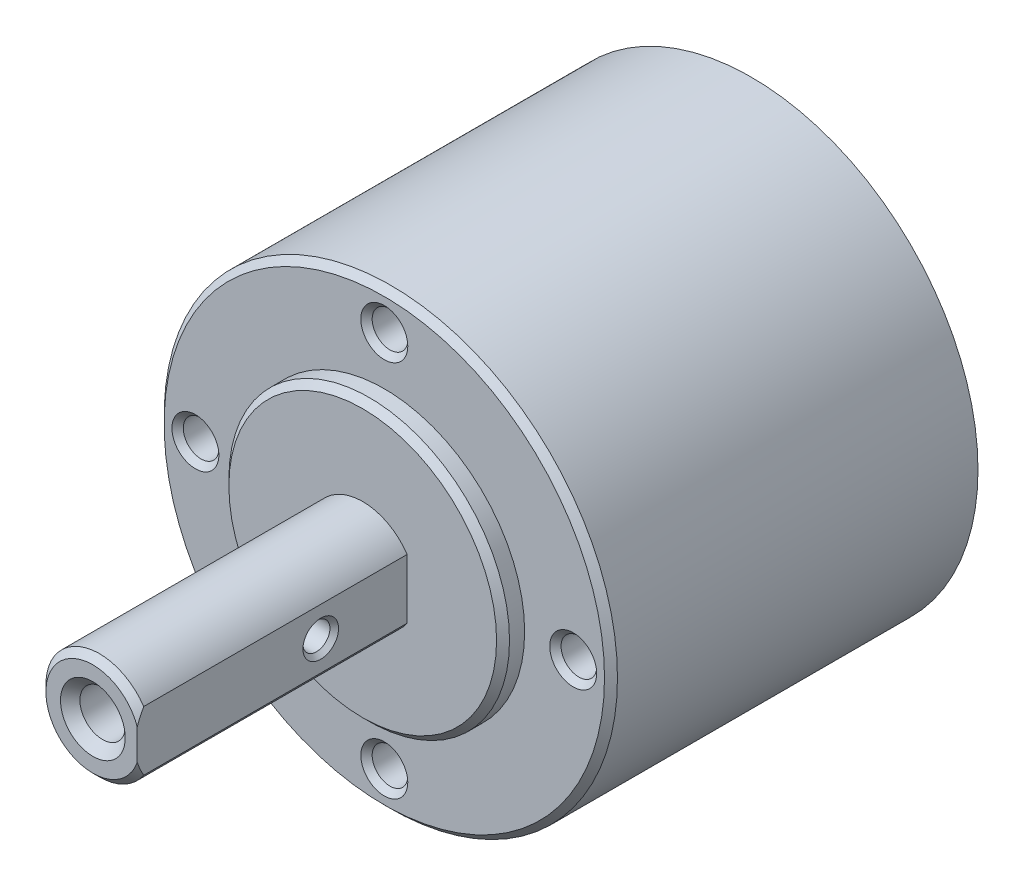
ISO-10303-21;
HEADER;
FILE_DESCRIPTION(('STEP AP214'),'2;1');
FILE_NAME('part.step','',(''),(''),'','','');
FILE_SCHEMA(('AUTOMOTIVE_DESIGN { 1 0 10303 214 1 1 1 1 }'));
ENDSEC;
DATA;
#1=APPLICATION_CONTEXT('core data for automotive mechanical design processes');
#2=APPLICATION_PROTOCOL_DEFINITION('international standard','automotive_design',2000,#1);
#3=PRODUCT_CONTEXT('',#1,'mechanical');
#4=PRODUCT('Part','Part','',(#3));
#5=PRODUCT_RELATED_PRODUCT_CATEGORY('part','',(#4));
#6=PRODUCT_DEFINITION_FORMATION('','',#4);
#7=PRODUCT_DEFINITION_CONTEXT('part definition',#1,'design');
#8=PRODUCT_DEFINITION('design','',#6,#7);
#9=PRODUCT_DEFINITION_SHAPE('','',#8);
#10=(LENGTH_UNIT() NAMED_UNIT(*) SI_UNIT(.MILLI.,.METRE.));
#11=(NAMED_UNIT(*) PLANE_ANGLE_UNIT() SI_UNIT($,.RADIAN.));
#12=(NAMED_UNIT(*) SI_UNIT($,.STERADIAN.) SOLID_ANGLE_UNIT());
#13=UNCERTAINTY_MEASURE_WITH_UNIT(LENGTH_MEASURE(1.E-05),#10,'distance_accuracy_value','');
#14=(GEOMETRIC_REPRESENTATION_CONTEXT(3) GLOBAL_UNCERTAINTY_ASSIGNED_CONTEXT((#13)) GLOBAL_UNIT_ASSIGNED_CONTEXT((#10,
#11,#12)) REPRESENTATION_CONTEXT('',''));
#15=CARTESIAN_POINT('',(0.,0.,0.));
#16=DIRECTION('',(0.,0.,1.));
#17=DIRECTION('',(1.,0.,0.));
#18=AXIS2_PLACEMENT_3D('',#15,#16,#17);
#19=CARTESIAN_POINT('',(0.,0.,34.));
#20=DIRECTION('',(0.,0.,-1.));
#21=DIRECTION('',(-1.,0.,0.));
#22=AXIS2_PLACEMENT_3D('',#19,#20,#21);
#23=CYLINDRICAL_SURFACE('',#22,21.);
#24=CARTESIAN_POINT('',(0.,0.,33.4));
#25=DIRECTION('',(0.,0.,1.));
#26=DIRECTION('',(1.,0.,0.));
#27=AXIS2_PLACEMENT_3D('',#24,#25,#26);
#28=CIRCLE('',#27,21.);
#29=CARTESIAN_POINT('',(21.,0.,33.4));
#30=VERTEX_POINT('',#29);
#31=EDGE_CURVE('E220',#30,#30,#28,.F.);
#32=ORIENTED_EDGE('',*,*,#31,.T.);
#33=EDGE_LOOP('',(#32));
#34=FACE_BOUND('',#33,.T.);
#35=CARTESIAN_POINT('',(0.,0.,0.));
#36=DIRECTION('',(0.,0.,1.));
#37=DIRECTION('',(1.,0.,0.));
#38=AXIS2_PLACEMENT_3D('',#35,#36,#37);
#39=CIRCLE('',#38,21.);
#40=CARTESIAN_POINT('',(21.,0.,0.));
#41=VERTEX_POINT('',#40);
#42=EDGE_CURVE('E158',#41,#41,#39,.T.);
#43=ORIENTED_EDGE('',*,*,#42,.T.);
#44=EDGE_LOOP('',(#43));
#45=FACE_BOUND('',#44,.T.);
#46=ADVANCED_FACE('F36',(#34,#45),#23,.T.);
#47=CARTESIAN_POINT('',(0.,0.,34.));
#48=DIRECTION('',(0.,0.,1.));
#49=DIRECTION('',(1.,0.,0.));
#50=AXIS2_PLACEMENT_3D('',#47,#48,#49);
#51=PLANE('',#50);
#52=CARTESIAN_POINT('',(0.,17.5,34.));
#53=DIRECTION('',(0.,0.,1.));
#54=DIRECTION('',(1.,0.,0.));
#55=AXIS2_PLACEMENT_3D('',#52,#53,#54);
#56=CIRCLE('',#55,2.175);
#57=CARTESIAN_POINT('',(2.175,17.5,34.));
#58=VERTEX_POINT('',#57);
#59=EDGE_CURVE('E100',#58,#58,#56,.T.);
#60=ORIENTED_EDGE('',*,*,#59,.F.);
#61=EDGE_LOOP('',(#60));
#62=FACE_BOUND('',#61,.T.);
#63=CARTESIAN_POINT('',(9.90473566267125E-13,-17.5,34.));
#64=DIRECTION('',(0.,0.,1.));
#65=DIRECTION('',(1.,0.,0.));
#66=AXIS2_PLACEMENT_3D('',#63,#64,#65);
#67=CIRCLE('',#66,2.175);
#68=CARTESIAN_POINT('',(2.17500000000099,-17.5,34.));
#69=VERTEX_POINT('',#68);
#70=EDGE_CURVE('E93',#69,#69,#67,.T.);
#71=ORIENTED_EDGE('',*,*,#70,.F.);
#72=EDGE_LOOP('',(#71));
#73=FACE_BOUND('',#72,.T.);
#74=CARTESIAN_POINT('',(-17.4999999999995,-4.9737991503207E-13,34.));
#75=DIRECTION('',(0.,0.,1.));
#76=DIRECTION('',(1.,0.,0.));
#77=AXIS2_PLACEMENT_3D('',#74,#75,#76);
#78=CIRCLE('',#77,2.175);
#79=CARTESIAN_POINT('',(-15.3249999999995,-4.9737991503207E-13,34.));
#80=VERTEX_POINT('',#79);
#81=EDGE_CURVE('E109',#80,#80,#78,.T.);
#82=ORIENTED_EDGE('',*,*,#81,.F.);
#83=EDGE_LOOP('',(#82));
#84=FACE_BOUND('',#83,.T.);
#85=CARTESIAN_POINT('',(17.5000000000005,4.95236783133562E-13,34.));
#86=DIRECTION('',(0.,0.,1.));
#87=DIRECTION('',(1.,0.,0.));
#88=AXIS2_PLACEMENT_3D('',#85,#86,#87);
#89=CIRCLE('',#88,2.175);
#90=CARTESIAN_POINT('',(19.6750000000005,4.95236783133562E-13,34.));
#91=VERTEX_POINT('',#90);
#92=EDGE_CURVE('E118',#91,#91,#89,.T.);
#93=ORIENTED_EDGE('',*,*,#92,.F.);
#94=EDGE_LOOP('',(#93));
#95=FACE_BOUND('',#94,.T.);
#96=CARTESIAN_POINT('',(0.,0.,34.));
#97=DIRECTION('',(0.,0.,1.));
#98=DIRECTION('',(1.,0.,0.));
#99=AXIS2_PLACEMENT_3D('',#96,#97,#98);
#100=CIRCLE('',#99,20.4);
#101=CARTESIAN_POINT('',(20.4,0.,34.));
#102=VERTEX_POINT('',#101);
#103=EDGE_CURVE('E161',#102,#102,#100,.T.);
#104=ORIENTED_EDGE('',*,*,#103,.T.);
#105=EDGE_LOOP('',(#104));
#106=FACE_BOUND('',#105,.T.);
#107=CARTESIAN_POINT('',(0.,0.,34.));
#108=DIRECTION('',(0.,0.,1.));
#109=DIRECTION('',(1.,0.,0.));
#110=AXIS2_PLACEMENT_3D('',#107,#108,#109);
#111=CIRCLE('',#110,13.);
#112=CARTESIAN_POINT('',(13.,0.,34.));
#113=VERTEX_POINT('',#112);
#114=EDGE_CURVE('E155',#113,#113,#111,.T.);
#115=ORIENTED_EDGE('',*,*,#114,.F.);
#116=EDGE_LOOP('',(#115));
#117=FACE_BOUND('',#116,.T.);
#118=ADVANCED_FACE('F227',(#62,#73,#84,#95,#106,#117),#51,.T.);
#119=CARTESIAN_POINT('',(0.,0.,0.));
#120=DIRECTION('',(0.,0.,1.));
#121=DIRECTION('',(1.,0.,0.));
#122=AXIS2_PLACEMENT_3D('',#119,#120,#121);
#123=PLANE('',#122);
#124=ORIENTED_EDGE('',*,*,#42,.F.);
#125=EDGE_LOOP('',(#124));
#126=FACE_BOUND('',#125,.T.);
#127=ADVANCED_FACE('F246',(#126),#123,.F.);
#128=CARTESIAN_POINT('',(0.,0.,36.));
#129=DIRECTION('',(0.,0.,-1.));
#130=DIRECTION('',(-1.,0.,0.));
#131=AXIS2_PLACEMENT_3D('',#128,#129,#130);
#132=CYLINDRICAL_SURFACE('',#131,13.);
#133=CARTESIAN_POINT('',(0.,0.,35.4));
#134=DIRECTION('',(0.,0.,1.));
#135=DIRECTION('',(1.,0.,0.));
#136=AXIS2_PLACEMENT_3D('',#133,#134,#135);
#137=CIRCLE('',#136,13.);
#138=CARTESIAN_POINT('',(13.,0.,35.4));
#139=VERTEX_POINT('',#138);
#140=EDGE_CURVE('E212',#139,#139,#137,.F.);
#141=ORIENTED_EDGE('',*,*,#140,.T.);
#142=EDGE_LOOP('',(#141));
#143=FACE_BOUND('',#142,.T.);
#144=ORIENTED_EDGE('',*,*,#114,.T.);
#145=EDGE_LOOP('',(#144));
#146=FACE_BOUND('',#145,.T.);
#147=ADVANCED_FACE('F252',(#143,#146),#132,.T.);
#148=CARTESIAN_POINT('',(0.,0.,36.));
#149=DIRECTION('',(0.,0.,1.));
#150=DIRECTION('',(1.,0.,0.));
#151=AXIS2_PLACEMENT_3D('',#148,#149,#150);
#152=PLANE('',#151);
#153=CARTESIAN_POINT('',(0.,0.,36.));
#154=DIRECTION('',(0.,0.,1.));
#155=DIRECTION('',(1.,0.,0.));
#156=AXIS2_PLACEMENT_3D('',#153,#154,#155);
#157=CIRCLE('',#156,12.4);
#158=CARTESIAN_POINT('',(12.4,0.,36.));
#159=VERTEX_POINT('',#158);
#160=EDGE_CURVE('E216',#159,#159,#157,.T.);
#161=ORIENTED_EDGE('',*,*,#160,.T.);
#162=EDGE_LOOP('',(#161));
#163=FACE_BOUND('',#162,.T.);
#164=CARTESIAN_POINT('',(0.,0.,36.));
#165=DIRECTION('',(0.,0.,1.));
#166=DIRECTION('',(1.,0.,0.));
#167=AXIS2_PLACEMENT_3D('',#164,#165,#166);
#168=CIRCLE('',#167,4.95);
#169=CARTESIAN_POINT('',(4.11111099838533,2.75703941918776,36.));
#170=VERTEX_POINT('',#169);
#171=CARTESIAN_POINT('',(4.11111099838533,-2.75703941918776,36.));
#172=VERTEX_POINT('',#171);
#173=EDGE_CURVE('E151',#170,#172,#168,.T.);
#174=ORIENTED_EDGE('',*,*,#173,.F.);
#175=DIRECTION('',(0.,-1.,0.));
#176=VECTOR('',#175,1.);
#177=CARTESIAN_POINT('',(4.11111099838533,-2.75703941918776,36.));
#178=LINE('',#177,#176);
#179=EDGE_CURVE('E144',#170,#172,#178,.T.);
#180=ORIENTED_EDGE('',*,*,#179,.T.);
#181=EDGE_LOOP('',(#174,#180));
#182=FACE_BOUND('',#181,.T.);
#183=ADVANCED_FACE('F256',(#163,#182),#152,.T.);
#184=CARTESIAN_POINT('',(0.,0.,61.));
#185=DIRECTION('',(0.,0.,-1.));
#186=DIRECTION('',(-1.,0.,0.));
#187=AXIS2_PLACEMENT_3D('',#184,#185,#186);
#188=CYLINDRICAL_SURFACE('',#187,4.95);
#189=CARTESIAN_POINT('',(-4.95,0.,42.75));
#190=CARTESIAN_POINT('',(-4.94999884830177,0.069040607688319,42.7500018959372));
#191=CARTESIAN_POINT('',(-4.94854120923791,0.138102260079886,42.7557391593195));
#192=CARTESIAN_POINT('',(-4.9428676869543,0.274244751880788,42.7785013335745));
#193=CARTESIAN_POINT('',(-4.93865027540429,0.341324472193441,42.7955324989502));
#194=CARTESIAN_POINT('',(-4.92792399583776,0.471517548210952,42.8403000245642));
#195=CARTESIAN_POINT('',(-4.92141791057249,0.534635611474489,42.8680233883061));
#196=CARTESIAN_POINT('',(-4.90680639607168,0.655325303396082,42.9333422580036));
#197=CARTESIAN_POINT('',(-4.89870090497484,0.712896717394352,42.9709381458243));
#198=CARTESIAN_POINT('',(-4.88157967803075,0.822066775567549,43.0557679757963));
#199=CARTESIAN_POINT('',(-4.8725496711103,0.873532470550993,43.103170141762));
#200=CARTESIAN_POINT('',(-4.85469148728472,0.967874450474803,43.2059068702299));
#201=CARTESIAN_POINT('',(-4.84586333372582,1.01074974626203,43.2612423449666));
#202=CARTESIAN_POINT('',(-4.82926422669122,1.0873225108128,43.3793114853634));
#203=CARTESIAN_POINT('',(-4.82151137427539,1.12087063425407,43.4421447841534));
#204=CARTESIAN_POINT('',(-4.80814905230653,1.1768761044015,43.5727867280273));
#205=CARTESIAN_POINT('',(-4.80253923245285,1.19933526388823,43.6405945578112));
#206=CARTESIAN_POINT('',(-4.79424491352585,1.23207051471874,43.7777972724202));
#207=CARTESIAN_POINT('',(-4.79150303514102,1.24258595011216,43.8471315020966));
#208=CARTESIAN_POINT('',(-4.78908333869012,1.25188087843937,43.9866299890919));
#209=CARTESIAN_POINT('',(-4.78940501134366,1.250662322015,44.0567941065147));
#210=CARTESIAN_POINT('',(-4.79302452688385,1.23671467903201,44.1941213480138));
#211=CARTESIAN_POINT('',(-4.79624845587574,1.22427144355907,44.2613157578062));
#212=CARTESIAN_POINT('',(-4.80519135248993,1.18868392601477,44.3926310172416));
#213=CARTESIAN_POINT('',(-4.81091050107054,1.1655388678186,44.4567516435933));
#214=CARTESIAN_POINT('',(-4.82426685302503,1.10896269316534,44.5808625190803));
#215=CARTESIAN_POINT('',(-4.83192315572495,1.0754283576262,44.6408035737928));
#216=CARTESIAN_POINT('',(-4.84828043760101,0.999097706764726,44.7543099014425));
#217=CARTESIAN_POINT('',(-4.85698160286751,0.956299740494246,44.8078740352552));
#218=CARTESIAN_POINT('',(-4.87475889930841,0.861178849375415,44.9087434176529));
#219=CARTESIAN_POINT('',(-4.88383857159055,0.808614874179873,44.9558210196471));
#220=CARTESIAN_POINT('',(-4.9011215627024,0.69622902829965,45.0405368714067));
#221=CARTESIAN_POINT('',(-4.90932485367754,0.636406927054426,45.078174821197));
#222=CARTESIAN_POINT('',(-4.92397298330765,0.510874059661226,45.1430289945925));
#223=CARTESIAN_POINT('',(-4.93041145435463,0.445143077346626,45.1702076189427));
#224=CARTESIAN_POINT('',(-4.94075824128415,0.309846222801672,45.2130655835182));
#225=CARTESIAN_POINT('',(-4.94466705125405,0.240281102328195,45.2287471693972));
#226=CARTESIAN_POINT('',(-4.94944074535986,0.101236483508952,45.247816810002));
#227=CARTESIAN_POINT('',(-4.95038235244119,0.0318020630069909,45.2515147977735));
#228=CARTESIAN_POINT('',(-4.94933437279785,-0.106693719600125,45.2473631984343));
#229=CARTESIAN_POINT('',(-4.94734505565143,-0.175755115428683,45.2395146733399));
#230=CARTESIAN_POINT('',(-4.94070797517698,-0.310463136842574,45.212748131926));
#231=CARTESIAN_POINT('',(-4.93610097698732,-0.376145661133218,45.1939997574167));
#232=CARTESIAN_POINT('',(-4.92474825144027,-0.503429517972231,45.1461599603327));
#233=CARTESIAN_POINT('',(-4.91800230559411,-0.565030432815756,45.1170674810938));
#234=CARTESIAN_POINT('',(-4.90293681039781,-0.683631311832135,45.0487684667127));
#235=CARTESIAN_POINT('',(-4.89459108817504,-0.74052832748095,45.0093890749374));
#236=CARTESIAN_POINT('',(-4.87729213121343,-0.847016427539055,44.9218544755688));
#237=CARTESIAN_POINT('',(-4.86833878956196,-0.896606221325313,44.8736977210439));
#238=CARTESIAN_POINT('',(-4.85055660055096,-0.988353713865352,44.768535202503));
#239=CARTESIAN_POINT('',(-4.84173650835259,-1.03029380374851,44.7113377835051));
#240=CARTESIAN_POINT('',(-4.82546947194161,-1.10398090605,44.590534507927));
#241=CARTESIAN_POINT('',(-4.81802246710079,-1.13572836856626,44.5269289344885));
#242=CARTESIAN_POINT('',(-4.80542748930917,-1.18789184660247,44.3954534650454));
#243=CARTESIAN_POINT('',(-4.80026594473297,-1.20837493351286,44.3276115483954));
#244=CARTESIAN_POINT('',(-4.79281456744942,-1.23760264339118,44.1892962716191));
#245=CARTESIAN_POINT('',(-4.79052409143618,-1.24634989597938,44.1188235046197));
#246=CARTESIAN_POINT('',(-4.78912392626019,-1.25171814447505,43.9794633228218));
#247=CARTESIAN_POINT('',(-4.78992292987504,-1.24868722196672,43.91059002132));
#248=CARTESIAN_POINT('',(-4.7944001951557,-1.23138339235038,43.7743706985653));
#249=CARTESIAN_POINT('',(-4.79807839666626,-1.21711072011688,43.7070246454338));
#250=CARTESIAN_POINT('',(-4.80784820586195,-1.17792042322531,43.5761587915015));
#251=CARTESIAN_POINT('',(-4.81392471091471,-1.15306933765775,43.5126178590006));
#252=CARTESIAN_POINT('',(-4.82780830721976,-1.09348010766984,43.3905614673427));
#253=CARTESIAN_POINT('',(-4.83561564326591,-1.05874056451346,43.3320467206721));
#254=CARTESIAN_POINT('',(-4.8523405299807,-0.979274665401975,43.2200247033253));
#255=CARTESIAN_POINT('',(-4.86128207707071,-0.934307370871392,43.1666919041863));
#256=CARTESIAN_POINT('',(-4.87912605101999,-0.836130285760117,43.0682158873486));
#257=CARTESIAN_POINT('',(-4.88802846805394,-0.782918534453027,43.0230746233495));
#258=CARTESIAN_POINT('',(-4.9049885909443,-0.668569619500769,42.9414441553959));
#259=CARTESIAN_POINT('',(-4.9130275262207,-0.607303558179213,42.905131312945));
#260=CARTESIAN_POINT('',(-4.92715586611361,-0.479338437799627,42.8433782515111));
#261=CARTESIAN_POINT('',(-4.93324664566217,-0.412643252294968,42.8179303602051));
#262=CARTESIAN_POINT('',(-4.94190849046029,-0.288404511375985,42.7823398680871));
#263=CARTESIAN_POINT('',(-4.94492177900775,-0.23144484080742,42.7702389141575));
#264=CARTESIAN_POINT('',(-4.94896794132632,-0.116328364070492,42.7540684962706));
#265=CARTESIAN_POINT('',(-4.95000097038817,-0.0581716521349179,42.7499984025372));
#266=CARTESIAN_POINT('',(-4.95,0.,42.75));
#267=B_SPLINE_CURVE_WITH_KNOTS('',3,(#189,#190,#191,#192,#193,#194,#195,#196,#197,#198,#199,
#200,#201,#202,#203,#204,#205,#206,#207,#208,#209,#210,#211,#212,#213,#214,#215,#216,#217,#218,
#219,#220,#221,#222,#223,#224,#225,#226,#227,#228,#229,#230,#231,#232,#233,#234,#235,#236,#237,
#238,#239,#240,#241,#242,#243,#244,#245,#246,#247,#248,#249,#250,#251,#252,#253,#254,#255,#256,
#257,#258,#259,#260,#261,#262,#263,#264,#265,#266),.UNSPECIFIED.,.T.,.F.,(4,2,2,2,2,2,2,2,2,2,2,
2,2,2,2,2,2,2,2,2,2,2,2,2,2,2,2,2,2,2,2,2,2,2,2,2,2,2,4),(0.,0.20690862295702,0.413931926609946,
0.620704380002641,0.827484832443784,1.03816071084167,1.24886083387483,1.46276232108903,
1.67662882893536,1.88612949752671,2.09559533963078,2.29987293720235,2.5041653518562,
2.71055631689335,2.91698409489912,3.12942231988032,3.34186729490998,3.55506898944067,
3.76822902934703,3.97583015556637,4.18341218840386,4.38784682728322,4.59230235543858,
4.8004432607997,5.00862088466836,5.22202001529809,5.43540972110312,5.64751469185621,
5.85957212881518,6.0654109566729,6.27124548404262,6.47580399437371,6.68039145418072,
6.89041766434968,7.1004939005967,7.31447381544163,7.52830237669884,7.7026513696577,
7.87698668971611),.UNSPECIFIED.);
#268=CARTESIAN_POINT('',(-4.95,0.,42.75));
#269=VERTEX_POINT('',#268);
#270=EDGE_CURVE('E133',#269,#269,#267,.T.);
#271=ORIENTED_EDGE('',*,*,#270,.T.);
#272=EDGE_LOOP('',(#271));
#273=FACE_BOUND('',#272,.T.);
#274=DIRECTION('',(0.,0.,1.));
#275=VECTOR('',#274,1.);
#276=CARTESIAN_POINT('',(4.11111099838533,-2.75703941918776,36.));
#277=LINE('',#276,#275);
#278=CARTESIAN_POINT('',(4.11111099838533,-2.75703941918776,60.4));
#279=VERTEX_POINT('',#278);
#280=EDGE_CURVE('E149',#172,#279,#277,.T.);
#281=ORIENTED_EDGE('',*,*,#280,.T.);
#282=CARTESIAN_POINT('',(0.,0.,60.4));
#283=DIRECTION('',(0.,0.,1.));
#284=DIRECTION('',(1.,0.,0.));
#285=AXIS2_PLACEMENT_3D('',#282,#283,#284);
#286=CIRCLE('',#285,4.95);
#287=CARTESIAN_POINT('',(4.11111099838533,2.75703941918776,60.4));
#288=VERTEX_POINT('',#287);
#289=EDGE_CURVE('E11',#279,#288,#286,.F.);
#290=ORIENTED_EDGE('',*,*,#289,.T.);
#291=DIRECTION('',(0.,0.,1.));
#292=VECTOR('',#291,1.);
#293=CARTESIAN_POINT('',(4.11111099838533,2.75703941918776,36.));
#294=LINE('',#293,#292);
#295=EDGE_CURVE('E147',#170,#288,#294,.T.);
#296=ORIENTED_EDGE('',*,*,#295,.F.);
#297=ORIENTED_EDGE('',*,*,#173,.T.);
#298=EDGE_LOOP('',(#281,#290,#296,#297));
#299=FACE_BOUND('',#298,.T.);
#300=ADVANCED_FACE('F169',(#273,#299),#188,.T.);
#301=CARTESIAN_POINT('',(0.,0.,61.));
#302=DIRECTION('',(0.,0.,1.));
#303=DIRECTION('',(1.,0.,0.));
#304=AXIS2_PLACEMENT_3D('',#301,#302,#303);
#305=PLANE('',#304);
#306=CARTESIAN_POINT('',(0.,0.,61.));
#307=DIRECTION('',(0.,0.,1.));
#308=DIRECTION('',(1.,0.,0.));
#309=AXIS2_PLACEMENT_3D('',#306,#307,#308);
#310=CIRCLE('',#309,3.);
#311=CARTESIAN_POINT('',(3.,0.,61.));
#312=VERTEX_POINT('',#311);
#313=EDGE_CURVE('E134',#312,#312,#310,.T.);
#314=ORIENTED_EDGE('',*,*,#313,.F.);
#315=EDGE_LOOP('',(#314));
#316=FACE_BOUND('',#315,.T.);
#317=DIRECTION('',(0.,-1.,0.));
#318=VECTOR('',#317,1.);
#319=CARTESIAN_POINT('',(4.11111099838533,-2.75703941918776,61.));
#320=LINE('',#319,#318);
#321=CARTESIAN_POINT('',(4.11111099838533,1.42171247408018,61.));
#322=VERTEX_POINT('',#321);
#323=CARTESIAN_POINT('',(4.11111099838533,-1.42171247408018,61.));
#324=VERTEX_POINT('',#323);
#325=EDGE_CURVE('E143',#322,#324,#320,.T.);
#326=ORIENTED_EDGE('',*,*,#325,.F.);
#327=CARTESIAN_POINT('',(0.,0.,61.));
#328=DIRECTION('',(0.,0.,1.));
#329=DIRECTION('',(1.,0.,0.));
#330=AXIS2_PLACEMENT_3D('',#327,#328,#329);
#331=CIRCLE('',#330,4.35);
#332=EDGE_CURVE('E208',#322,#324,#331,.T.);
#333=ORIENTED_EDGE('',*,*,#332,.T.);
#334=EDGE_LOOP('',(#326,#333));
#335=FACE_BOUND('',#334,.T.);
#336=ADVANCED_FACE('F196',(#316,#335),#305,.T.);
#337=CARTESIAN_POINT('',(4.11111099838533,-2.75703941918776,36.));
#338=DIRECTION('',(-1.,0.,0.));
#339=DIRECTION('',(0.,0.,1.));
#340=AXIS2_PLACEMENT_3D('',#337,#338,#339);
#341=PLANE('',#340);
#342=CARTESIAN_POINT('',(4.11111099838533,0.,44.));
#343=DIRECTION('',(1.,0.,0.));
#344=DIRECTION('',(0.,0.,-1.));
#345=AXIS2_PLACEMENT_3D('',#342,#343,#344);
#346=CIRCLE('',#345,1.65);
#347=CARTESIAN_POINT('',(4.11111099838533,0.,42.35));
#348=VERTEX_POINT('',#347);
#349=EDGE_CURVE('E127',#348,#348,#346,.T.);
#350=ORIENTED_EDGE('',*,*,#349,.F.);
#351=EDGE_LOOP('',(#350));
#352=FACE_BOUND('',#351,.T.);
#353=ORIENTED_EDGE('',*,*,#325,.T.);
#354=CARTESIAN_POINT('',(4.11111099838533,-1.42171247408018,61.));
#355=CARTESIAN_POINT('',(4.11111099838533,-1.5380434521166,60.9619661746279));
#356=CARTESIAN_POINT('',(4.11111099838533,-1.65308972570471,60.9202101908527));
#357=CARTESIAN_POINT('',(4.11111099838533,-1.88042548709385,60.8304510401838));
#358=CARTESIAN_POINT('',(4.11111099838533,-1.99272067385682,60.7824623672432));
#359=CARTESIAN_POINT('',(4.11111099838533,-2.21484452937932,60.6812754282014));
#360=CARTESIAN_POINT('',(4.11111099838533,-2.32467435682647,60.6280796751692));
#361=CARTESIAN_POINT('',(4.11111099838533,-2.54235992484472,60.5171855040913));
#362=CARTESIAN_POINT('',(4.11111099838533,-2.65021057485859,60.4594770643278));
#363=CARTESIAN_POINT('',(4.11111099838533,-2.75703941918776,60.4));
#364=B_SPLINE_CURVE_WITH_KNOTS('',3,(#354,#355,#356,#357,#358,#359,#360,#361,#362,#363),
.UNSPECIFIED.,.F.,.F.,(4,2,2,2,4),(0.,0.367016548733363,0.733194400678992,1.0991963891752,
1.46603562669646),.UNSPECIFIED.);
#365=EDGE_CURVE('E45',#324,#279,#364,.T.);
#366=ORIENTED_EDGE('',*,*,#365,.T.);
#367=ORIENTED_EDGE('',*,*,#280,.F.);
#368=ORIENTED_EDGE('',*,*,#179,.F.);
#369=ORIENTED_EDGE('',*,*,#295,.T.);
#370=CARTESIAN_POINT('',(4.11111099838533,2.75703941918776,60.4));
#371=CARTESIAN_POINT('',(4.11111099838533,2.65021057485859,60.4594770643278));
#372=CARTESIAN_POINT('',(4.11111099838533,2.54235992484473,60.5171855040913));
#373=CARTESIAN_POINT('',(4.11111099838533,2.32467435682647,60.6280796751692));
#374=CARTESIAN_POINT('',(4.11111099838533,2.21484452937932,60.6812754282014));
#375=CARTESIAN_POINT('',(4.11111099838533,1.99272067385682,60.7824623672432));
#376=CARTESIAN_POINT('',(4.11111099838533,1.88042548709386,60.8304510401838));
#377=CARTESIAN_POINT('',(4.11111099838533,1.65308972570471,60.9202101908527));
#378=CARTESIAN_POINT('',(4.11111099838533,1.5380434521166,60.961966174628));
#379=CARTESIAN_POINT('',(4.11111099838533,1.42171247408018,61.));
#380=B_SPLINE_CURVE_WITH_KNOTS('',3,(#370,#371,#372,#373,#374,#375,#376,#377,#378,#379),
.UNSPECIFIED.,.F.,.F.,(4,2,2,2,4),(0.,0.366839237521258,0.732841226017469,1.09901907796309,
1.46603562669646),.UNSPECIFIED.);
#381=EDGE_CURVE('E200',#288,#322,#380,.T.);
#382=ORIENTED_EDGE('',*,*,#381,.T.);
#383=EDGE_LOOP('',(#353,#366,#367,#368,#369,#382));
#384=FACE_BOUND('',#383,.T.);
#385=ADVANCED_FACE('F192',(#352,#384),#341,.F.);
#386=CARTESIAN_POINT('',(0.,0.,47.));
#387=DIRECTION('',(0.,0.,1.));
#388=DIRECTION('',(1.,0.,0.));
#389=AXIS2_PLACEMENT_3D('',#386,#387,#388);
#390=CONICAL_SURFACE('',#389,2.09999999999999,1.02974425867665);
#391=CARTESIAN_POINT('',(0.,0.,45.7381927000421));
#392=VERTEX_POINT('',#391);
#393=VERTEX_LOOP('',#392);
#394=FACE_BOUND('',#393,.T.);
#395=CARTESIAN_POINT('',(0.,0.,47.));
#396=DIRECTION('',(0.,0.,1.));
#397=DIRECTION('',(1.,0.,0.));
#398=AXIS2_PLACEMENT_3D('',#395,#396,#397);
#399=CIRCLE('',#398,2.09999999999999);
#400=CARTESIAN_POINT('',(2.09999999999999,0.,47.));
#401=VERTEX_POINT('',#400);
#402=EDGE_CURVE('E140',#401,#401,#399,.T.);
#403=ORIENTED_EDGE('',*,*,#402,.T.);
#404=EDGE_LOOP('',(#403));
#405=FACE_BOUND('',#404,.T.);
#406=ADVANCED_FACE('F188',(#394,#405),#390,.F.);
#407=CARTESIAN_POINT('',(0.,0.,61.));
#408=DIRECTION('',(0.,0.,1.));
#409=DIRECTION('',(1.,0.,0.));
#410=AXIS2_PLACEMENT_3D('',#407,#408,#409);
#411=CYLINDRICAL_SURFACE('',#410,2.09999999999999);
#412=ORIENTED_EDGE('',*,*,#402,.F.);
#413=EDGE_LOOP('',(#412));
#414=FACE_BOUND('',#413,.T.);
#415=CARTESIAN_POINT('',(0.,0.,60.1));
#416=DIRECTION('',(0.,0.,1.));
#417=DIRECTION('',(1.,0.,0.));
#418=AXIS2_PLACEMENT_3D('',#415,#416,#417);
#419=CIRCLE('',#418,2.1);
#420=CARTESIAN_POINT('',(2.1,0.,60.1));
#421=VERTEX_POINT('',#420);
#422=EDGE_CURVE('E137',#421,#421,#419,.T.);
#423=ORIENTED_EDGE('',*,*,#422,.T.);
#424=EDGE_LOOP('',(#423));
#425=FACE_BOUND('',#424,.T.);
#426=ADVANCED_FACE('F184',(#414,#425),#411,.F.);
#427=CARTESIAN_POINT('',(0.,0.,61.));
#428=DIRECTION('',(0.,0.,1.));
#429=DIRECTION('',(1.,0.,0.));
#430=AXIS2_PLACEMENT_3D('',#427,#428,#429);
#431=CONICAL_SURFACE('',#430,3.,0.785398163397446);
#432=ORIENTED_EDGE('',*,*,#422,.F.);
#433=EDGE_LOOP('',(#432));
#434=FACE_BOUND('',#433,.T.);
#435=ORIENTED_EDGE('',*,*,#313,.T.);
#436=EDGE_LOOP('',(#435));
#437=FACE_BOUND('',#436,.T.);
#438=ADVANCED_FACE('F179',(#434,#437),#431,.F.);
#439=CARTESIAN_POINT('',(4.11111099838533,0.,44.));
#440=DIRECTION('',(1.,0.,0.));
#441=DIRECTION('',(0.,0.,-1.));
#442=AXIS2_PLACEMENT_3D('',#439,#440,#441);
#443=CYLINDRICAL_SURFACE('',#442,1.25);
#444=CARTESIAN_POINT('',(3.71111099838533,0.,44.));
#445=DIRECTION('',(1.,0.,0.));
#446=DIRECTION('',(0.,0.,-1.));
#447=AXIS2_PLACEMENT_3D('',#444,#445,#446);
#448=CIRCLE('',#447,1.25);
#449=CARTESIAN_POINT('',(3.71111099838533,0.,42.75));
#450=VERTEX_POINT('',#449);
#451=EDGE_CURVE('E130',#450,#450,#448,.T.);
#452=ORIENTED_EDGE('',*,*,#451,.T.);
#453=EDGE_LOOP('',(#452));
#454=FACE_BOUND('',#453,.T.);
#455=ORIENTED_EDGE('',*,*,#270,.F.);
#456=EDGE_LOOP('',(#455));
#457=FACE_BOUND('',#456,.T.);
#458=ADVANCED_FACE('F173',(#454,#457),#443,.F.);
#459=CARTESIAN_POINT('',(4.11111099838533,0.,44.));
#460=DIRECTION('',(1.,0.,0.));
#461=DIRECTION('',(0.,0.,-1.));
#462=AXIS2_PLACEMENT_3D('',#459,#460,#461);
#463=CONICAL_SURFACE('',#462,1.65,0.785398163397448);
#464=ORIENTED_EDGE('',*,*,#451,.F.);
#465=EDGE_LOOP('',(#464));
#466=FACE_BOUND('',#465,.T.);
#467=ORIENTED_EDGE('',*,*,#349,.T.);
#468=EDGE_LOOP('',(#467));
#469=FACE_BOUND('',#468,.T.);
#470=ADVANCED_FACE('F178',(#466,#469),#463,.F.);
#471=CARTESIAN_POINT('',(0.,0.,34.));
#472=DIRECTION('',(0.,0.,-1.));
#473=DIRECTION('',(-1.,0.,0.));
#474=AXIS2_PLACEMENT_3D('',#471,#472,#473);
#475=CONICAL_SURFACE('',#474,20.4,0.785398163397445);
#476=ORIENTED_EDGE('',*,*,#31,.F.);
#477=EDGE_LOOP('',(#476));
#478=FACE_BOUND('',#477,.T.);
#479=ORIENTED_EDGE('',*,*,#103,.F.);
#480=EDGE_LOOP('',(#479));
#481=FACE_BOUND('',#480,.T.);
#482=ADVANCED_FACE('F230',(#478,#481),#475,.T.);
#483=CARTESIAN_POINT('',(0.,0.,36.));
#484=DIRECTION('',(0.,0.,-1.));
#485=DIRECTION('',(-1.,0.,0.));
#486=AXIS2_PLACEMENT_3D('',#483,#484,#485);
#487=CONICAL_SURFACE('',#486,12.4,0.785398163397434);
#488=ORIENTED_EDGE('',*,*,#140,.F.);
#489=EDGE_LOOP('',(#488));
#490=FACE_BOUND('',#489,.T.);
#491=ORIENTED_EDGE('',*,*,#160,.F.);
#492=EDGE_LOOP('',(#491));
#493=FACE_BOUND('',#492,.T.);
#494=ADVANCED_FACE('F232',(#490,#493),#487,.T.);
#495=CARTESIAN_POINT('',(0.,0.,61.));
#496=DIRECTION('',(0.,0.,-1.));
#497=DIRECTION('',(-1.,0.,0.));
#498=AXIS2_PLACEMENT_3D('',#495,#496,#497);
#499=CONICAL_SURFACE('',#498,4.35,0.785398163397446);
#500=ORIENTED_EDGE('',*,*,#381,.F.);
#501=ORIENTED_EDGE('',*,*,#289,.F.);
#502=ORIENTED_EDGE('',*,*,#365,.F.);
#503=ORIENTED_EDGE('',*,*,#332,.F.);
#504=EDGE_LOOP('',(#500,#501,#502,#503));
#505=FACE_BOUND('',#504,.T.);
#506=ADVANCED_FACE('F38',(#505),#499,.T.);
#507=CARTESIAN_POINT('',(17.5000000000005,4.95236783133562E-13,22.5));
#508=DIRECTION('',(0.,0.,1.));
#509=DIRECTION('',(1.,0.,0.));
#510=AXIS2_PLACEMENT_3D('',#507,#508,#509);
#511=CONICAL_SURFACE('',#510,1.65,1.02974425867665);
#512=CARTESIAN_POINT('',(17.5000000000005,4.95236783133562E-13,21.5085799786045));
#513=VERTEX_POINT('',#512);
#514=VERTEX_LOOP('',#513);
#515=FACE_BOUND('',#514,.T.);
#516=CARTESIAN_POINT('',(17.5000000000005,4.95236783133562E-13,22.5));
#517=DIRECTION('',(0.,0.,1.));
#518=DIRECTION('',(1.,0.,0.));
#519=AXIS2_PLACEMENT_3D('',#516,#517,#518);
#520=CIRCLE('',#519,1.65);
#521=CARTESIAN_POINT('',(19.1500000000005,4.95236783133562E-13,22.5));
#522=VERTEX_POINT('',#521);
#523=EDGE_CURVE('E124',#522,#522,#520,.T.);
#524=ORIENTED_EDGE('',*,*,#523,.T.);
#525=EDGE_LOOP('',(#524));
#526=FACE_BOUND('',#525,.T.);
#527=ADVANCED_FACE('F269',(#515,#526),#511,.F.);
#528=CARTESIAN_POINT('',(17.5000000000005,4.95236783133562E-13,34.));
#529=DIRECTION('',(0.,0.,1.));
#530=DIRECTION('',(1.,0.,0.));
#531=AXIS2_PLACEMENT_3D('',#528,#529,#530);
#532=CYLINDRICAL_SURFACE('',#531,1.65);
#533=ORIENTED_EDGE('',*,*,#523,.F.);
#534=EDGE_LOOP('',(#533));
#535=FACE_BOUND('',#534,.T.);
#536=CARTESIAN_POINT('',(17.5000000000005,4.95236783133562E-13,33.475));
#537=DIRECTION('',(0.,0.,1.));
#538=DIRECTION('',(1.,0.,0.));
#539=AXIS2_PLACEMENT_3D('',#536,#537,#538);
#540=CIRCLE('',#539,1.65);
#541=CARTESIAN_POINT('',(19.1500000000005,4.95236783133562E-13,33.475));
#542=VERTEX_POINT('',#541);
#543=EDGE_CURVE('E121',#542,#542,#540,.T.);
#544=ORIENTED_EDGE('',*,*,#543,.T.);
#545=EDGE_LOOP('',(#544));
#546=FACE_BOUND('',#545,.T.);
#547=ADVANCED_FACE('F273',(#535,#546),#532,.F.);
#548=CARTESIAN_POINT('',(17.5000000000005,4.95236783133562E-13,34.));
#549=DIRECTION('',(0.,0.,1.));
#550=DIRECTION('',(1.,0.,0.));
#551=AXIS2_PLACEMENT_3D('',#548,#549,#550);
#552=CONICAL_SURFACE('',#551,2.175,0.785398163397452);
#553=ORIENTED_EDGE('',*,*,#543,.F.);
#554=EDGE_LOOP('',(#553));
#555=FACE_BOUND('',#554,.T.);
#556=ORIENTED_EDGE('',*,*,#92,.T.);
#557=EDGE_LOOP('',(#556));
#558=FACE_BOUND('',#557,.T.);
#559=ADVANCED_FACE('F278',(#555,#558),#552,.F.);
#560=CARTESIAN_POINT('',(-17.4999999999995,-4.9737991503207E-13,22.5));
#561=DIRECTION('',(0.,0.,1.));
#562=DIRECTION('',(1.,0.,0.));
#563=AXIS2_PLACEMENT_3D('',#560,#561,#562);
#564=CONICAL_SURFACE('',#563,1.65,1.02974425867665);
#565=CARTESIAN_POINT('',(-17.4999999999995,-4.9737991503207E-13,21.5085799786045));
#566=VERTEX_POINT('',#565);
#567=VERTEX_LOOP('',#566);
#568=FACE_BOUND('',#567,.T.);
#569=CARTESIAN_POINT('',(-17.4999999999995,-4.9737991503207E-13,22.5));
#570=DIRECTION('',(0.,0.,1.));
#571=DIRECTION('',(1.,0.,0.));
#572=AXIS2_PLACEMENT_3D('',#569,#570,#571);
#573=CIRCLE('',#572,1.65);
#574=CARTESIAN_POINT('',(-15.8499999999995,-4.9737991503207E-13,22.5));
#575=VERTEX_POINT('',#574);
#576=EDGE_CURVE('E115',#575,#575,#573,.T.);
#577=ORIENTED_EDGE('',*,*,#576,.T.);
#578=EDGE_LOOP('',(#577));
#579=FACE_BOUND('',#578,.T.);
#580=ADVANCED_FACE('F285',(#568,#579),#564,.F.);
#581=CARTESIAN_POINT('',(-17.4999999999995,-4.9737991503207E-13,34.));
#582=DIRECTION('',(0.,0.,1.));
#583=DIRECTION('',(1.,0.,0.));
#584=AXIS2_PLACEMENT_3D('',#581,#582,#583);
#585=CYLINDRICAL_SURFACE('',#584,1.65);
#586=ORIENTED_EDGE('',*,*,#576,.F.);
#587=EDGE_LOOP('',(#586));
#588=FACE_BOUND('',#587,.T.);
#589=CARTESIAN_POINT('',(-17.4999999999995,-4.9737991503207E-13,33.475));
#590=DIRECTION('',(0.,0.,1.));
#591=DIRECTION('',(1.,0.,0.));
#592=AXIS2_PLACEMENT_3D('',#589,#590,#591);
#593=CIRCLE('',#592,1.65);
#594=CARTESIAN_POINT('',(-15.8499999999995,-4.9737991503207E-13,33.475));
#595=VERTEX_POINT('',#594);
#596=EDGE_CURVE('E112',#595,#595,#593,.T.);
#597=ORIENTED_EDGE('',*,*,#596,.T.);
#598=EDGE_LOOP('',(#597));
#599=FACE_BOUND('',#598,.T.);
#600=ADVANCED_FACE('F289',(#588,#599),#585,.F.);
#601=CARTESIAN_POINT('',(-17.4999999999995,-4.9737991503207E-13,34.));
#602=DIRECTION('',(0.,0.,1.));
#603=DIRECTION('',(1.,0.,0.));
#604=AXIS2_PLACEMENT_3D('',#601,#602,#603);
#605=CONICAL_SURFACE('',#604,2.175,0.785398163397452);
#606=ORIENTED_EDGE('',*,*,#596,.F.);
#607=EDGE_LOOP('',(#606));
#608=FACE_BOUND('',#607,.T.);
#609=ORIENTED_EDGE('',*,*,#81,.T.);
#610=EDGE_LOOP('',(#609));
#611=FACE_BOUND('',#610,.T.);
#612=ADVANCED_FACE('F293',(#608,#611),#605,.F.);
#613=CARTESIAN_POINT('',(9.90473566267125E-13,-17.5,22.5));
#614=DIRECTION('',(0.,0.,1.));
#615=DIRECTION('',(1.,0.,0.));
#616=AXIS2_PLACEMENT_3D('',#613,#614,#615);
#617=CONICAL_SURFACE('',#616,1.65,1.02974425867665);
#618=CARTESIAN_POINT('',(9.87414050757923E-13,-17.5,21.5085799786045));
#619=VERTEX_POINT('',#618);
#620=VERTEX_LOOP('',#619);
#621=FACE_BOUND('',#620,.T.);
#622=CARTESIAN_POINT('',(9.90473566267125E-13,-17.5,22.5));
#623=DIRECTION('',(0.,0.,1.));
#624=DIRECTION('',(1.,0.,0.));
#625=AXIS2_PLACEMENT_3D('',#622,#623,#624);
#626=CIRCLE('',#625,1.65);
#627=CARTESIAN_POINT('',(1.65000000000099,-17.5,22.5));
#628=VERTEX_POINT('',#627);
#629=EDGE_CURVE('E106',#628,#628,#626,.T.);
#630=ORIENTED_EDGE('',*,*,#629,.T.);
#631=EDGE_LOOP('',(#630));
#632=FACE_BOUND('',#631,.T.);
#633=ADVANCED_FACE('F297',(#621,#632),#617,.F.);
#634=CARTESIAN_POINT('',(9.90473566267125E-13,-17.5,34.));
#635=DIRECTION('',(0.,0.,1.));
#636=DIRECTION('',(1.,0.,0.));
#637=AXIS2_PLACEMENT_3D('',#634,#635,#636);
#638=CYLINDRICAL_SURFACE('',#637,1.65);
#639=ORIENTED_EDGE('',*,*,#629,.F.);
#640=EDGE_LOOP('',(#639));
#641=FACE_BOUND('',#640,.T.);
#642=CARTESIAN_POINT('',(9.90473566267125E-13,-17.5,33.475));
#643=DIRECTION('',(0.,0.,1.));
#644=DIRECTION('',(1.,0.,0.));
#645=AXIS2_PLACEMENT_3D('',#642,#643,#644);
#646=CIRCLE('',#645,1.65);
#647=CARTESIAN_POINT('',(1.65000000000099,-17.5,33.475));
#648=VERTEX_POINT('',#647);
#649=EDGE_CURVE('E97',#648,#648,#646,.T.);
#650=ORIENTED_EDGE('',*,*,#649,.T.);
#651=EDGE_LOOP('',(#650));
#652=FACE_BOUND('',#651,.T.);
#653=ADVANCED_FACE('F301',(#641,#652),#638,.F.);
#654=CARTESIAN_POINT('',(9.90473566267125E-13,-17.5,34.));
#655=DIRECTION('',(0.,0.,1.));
#656=DIRECTION('',(1.,0.,0.));
#657=AXIS2_PLACEMENT_3D('',#654,#655,#656);
#658=CONICAL_SURFACE('',#657,2.175,0.785398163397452);
#659=ORIENTED_EDGE('',*,*,#649,.F.);
#660=EDGE_LOOP('',(#659));
#661=FACE_BOUND('',#660,.T.);
#662=ORIENTED_EDGE('',*,*,#70,.T.);
#663=EDGE_LOOP('',(#662));
#664=FACE_BOUND('',#663,.T.);
#665=ADVANCED_FACE('F87',(#661,#664),#658,.F.);
#666=CARTESIAN_POINT('',(0.,17.5,22.5));
#667=DIRECTION('',(0.,0.,1.));
#668=DIRECTION('',(1.,0.,0.));
#669=AXIS2_PLACEMENT_3D('',#666,#667,#668);
#670=CONICAL_SURFACE('',#669,1.65,1.02974425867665);
#671=CARTESIAN_POINT('',(0.,17.5,21.5085799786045));
#672=VERTEX_POINT('',#671);
#673=VERTEX_LOOP('',#672);
#674=FACE_BOUND('',#673,.T.);
#675=CARTESIAN_POINT('',(0.,17.5,22.5));
#676=DIRECTION('',(0.,0.,1.));
#677=DIRECTION('',(1.,0.,0.));
#678=AXIS2_PLACEMENT_3D('',#675,#676,#677);
#679=CIRCLE('',#678,1.65);
#680=CARTESIAN_POINT('',(1.65,17.5,22.5));
#681=VERTEX_POINT('',#680);
#682=EDGE_CURVE('E91',#681,#681,#679,.T.);
#683=ORIENTED_EDGE('',*,*,#682,.T.);
#684=EDGE_LOOP('',(#683));
#685=FACE_BOUND('',#684,.T.);
#686=ADVANCED_FACE('F83',(#674,#685),#670,.F.);
#687=CARTESIAN_POINT('',(0.,17.5,34.));
#688=DIRECTION('',(0.,0.,1.));
#689=DIRECTION('',(1.,0.,0.));
#690=AXIS2_PLACEMENT_3D('',#687,#688,#689);
#691=CYLINDRICAL_SURFACE('',#690,1.65);
#692=ORIENTED_EDGE('',*,*,#682,.F.);
#693=EDGE_LOOP('',(#692));
#694=FACE_BOUND('',#693,.T.);
#695=CARTESIAN_POINT('',(0.,17.5,33.475));
#696=DIRECTION('',(0.,0.,1.));
#697=DIRECTION('',(1.,0.,0.));
#698=AXIS2_PLACEMENT_3D('',#695,#696,#697);
#699=CIRCLE('',#698,1.65);
#700=CARTESIAN_POINT('',(1.65,17.5,33.475));
#701=VERTEX_POINT('',#700);
#702=EDGE_CURVE('E94',#701,#701,#699,.T.);
#703=ORIENTED_EDGE('',*,*,#702,.T.);
#704=EDGE_LOOP('',(#703));
#705=FACE_BOUND('',#704,.T.);
#706=ADVANCED_FACE('F86',(#694,#705),#691,.F.);
#707=CARTESIAN_POINT('',(0.,17.5,34.));
#708=DIRECTION('',(0.,0.,1.));
#709=DIRECTION('',(1.,0.,0.));
#710=AXIS2_PLACEMENT_3D('',#707,#708,#709);
#711=CONICAL_SURFACE('',#710,2.175,0.785398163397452);
#712=ORIENTED_EDGE('',*,*,#702,.F.);
#713=EDGE_LOOP('',(#712));
#714=FACE_BOUND('',#713,.T.);
#715=ORIENTED_EDGE('',*,*,#59,.T.);
#716=EDGE_LOOP('',(#715));
#717=FACE_BOUND('',#716,.T.);
#718=ADVANCED_FACE('F311',(#714,#717),#711,.F.);
#719=CLOSED_SHELL('',(#46,#118,#127,#147,#183,#300,#336,#385,#406,#426,#438,#458,#470,#482,#494,
#506,#527,#547,#559,#580,#600,#612,#633,#653,#665,#686,#706,#718));
#720=MANIFOLD_SOLID_BREP('B2',#719);
#721=ADVANCED_BREP_SHAPE_REPRESENTATION('',(#18,#720),#14);
#722=SHAPE_DEFINITION_REPRESENTATION(#9,#721);
ENDSEC;
END-ISO-10303-21;
